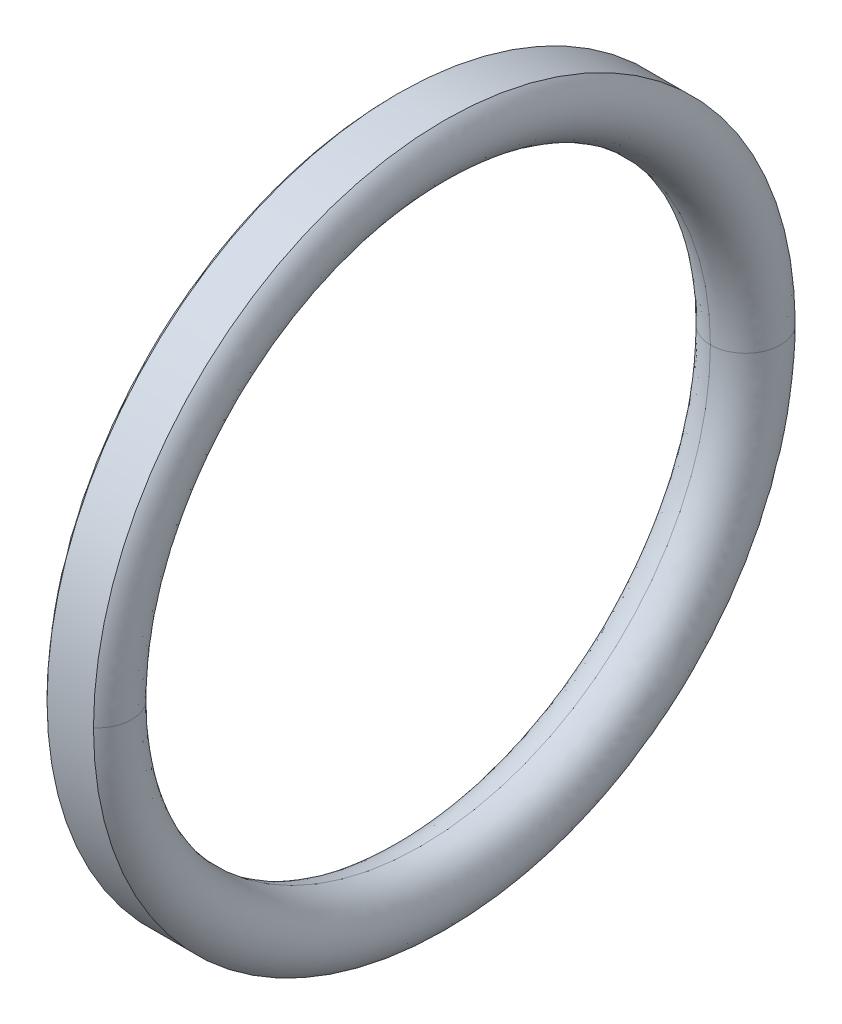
ISO-10303-21;
HEADER;
FILE_DESCRIPTION(('STEP AP214'),'2;1');
FILE_NAME('part.step','',(''),(''),'','','');
FILE_SCHEMA(('AUTOMOTIVE_DESIGN { 1 0 10303 214 1 1 1 1 }'));
ENDSEC;
DATA;
#1=APPLICATION_CONTEXT('core data for automotive mechanical design processes');
#2=APPLICATION_PROTOCOL_DEFINITION('international standard','automotive_design',2000,#1);
#3=PRODUCT_CONTEXT('',#1,'mechanical');
#4=PRODUCT('Part','Part','',(#3));
#5=PRODUCT_RELATED_PRODUCT_CATEGORY('part','',(#4));
#6=PRODUCT_DEFINITION_FORMATION('','',#4);
#7=PRODUCT_DEFINITION_CONTEXT('part definition',#1,'design');
#8=PRODUCT_DEFINITION('design','',#6,#7);
#9=PRODUCT_DEFINITION_SHAPE('','',#8);
#10=(LENGTH_UNIT() NAMED_UNIT(*) SI_UNIT(.MILLI.,.METRE.));
#11=(NAMED_UNIT(*) PLANE_ANGLE_UNIT() SI_UNIT($,.RADIAN.));
#12=(NAMED_UNIT(*) SI_UNIT($,.STERADIAN.) SOLID_ANGLE_UNIT());
#13=UNCERTAINTY_MEASURE_WITH_UNIT(LENGTH_MEASURE(1.E-05),#10,'distance_accuracy_value','');
#14=(GEOMETRIC_REPRESENTATION_CONTEXT(3) GLOBAL_UNCERTAINTY_ASSIGNED_CONTEXT((#13)) GLOBAL_UNIT_ASSIGNED_CONTEXT((#10,
#11,#12)) REPRESENTATION_CONTEXT('',''));
#15=CARTESIAN_POINT('',(0.,0.,0.));
#16=DIRECTION('',(0.,0.,1.));
#17=DIRECTION('',(1.,0.,0.));
#18=AXIS2_PLACEMENT_3D('',#15,#16,#17);
#19=CARTESIAN_POINT('',(0.,0.,8.25));
#20=CARTESIAN_POINT('',(0.,16.5,8.25));
#21=CARTESIAN_POINT('',(0.,16.5,-8.25));
#22=CARTESIAN_POINT('',(0.,0.,-8.25));
#23=CARTESIAN_POINT('',(-1.095906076,0.,8.25));
#24=CARTESIAN_POINT('',(-1.095906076,16.5,8.25));
#25=CARTESIAN_POINT('',(-1.095906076,16.5,-8.25));
#26=CARTESIAN_POINT('',(-1.095906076,0.,-8.25));
#27=CARTESIAN_POINT('',(-1.483367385,0.,9.275126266));
#28=CARTESIAN_POINT('',(-1.483367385,18.550252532,9.275126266));
#29=CARTESIAN_POINT('',(-1.483367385,18.550252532,-9.275126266));
#30=CARTESIAN_POINT('',(-1.483367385,0.,-9.275126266));
#31=CARTESIAN_POINT('',(-0.661437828,0.,10.));
#32=CARTESIAN_POINT('',(-0.661437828,20.,10.));
#33=CARTESIAN_POINT('',(-0.661437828,20.,-10.));
#34=CARTESIAN_POINT('',(-0.661437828,0.,-10.));
#35=(BOUNDED_SURFACE() B_SPLINE_SURFACE(3,3,((#19,#20,#21,#22),(#23,#24,#25,#26),(#27,#28,#29,
#30),(#31,#32,#33,#34)),.UNSPECIFIED.,.F.,.F.,.F.) B_SPLINE_SURFACE_WITH_KNOTS((4,4),(4,4),(0.,
1.),(0.,1.),.UNSPECIFIED.) GEOMETRIC_REPRESENTATION_ITEM() RATIONAL_B_SPLINE_SURFACE(((1.,
0.333333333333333,0.333333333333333,1.),(0.569035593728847,0.189678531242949,0.189678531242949,
0.569035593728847),(0.569035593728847,0.189678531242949,0.189678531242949,0.569035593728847),
(1.,0.333333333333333,0.333333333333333,1.))) REPRESENTATION_ITEM('') SURFACE());
#36=CARTESIAN_POINT('',(-0.661437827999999,0.,0.));
#37=DIRECTION('',(-1.,0.,0.));
#38=DIRECTION('',(0.,0.,1.));
#39=AXIS2_PLACEMENT_3D('',#36,#37,#38);
#40=CIRCLE('',#39,10.);
#41=CARTESIAN_POINT('',(-0.661437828,-1.53827571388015E-09,-10.));
#42=VERTEX_POINT('',#41);
#43=CARTESIAN_POINT('',(-0.661437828,-2.24484071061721E-10,10.));
#44=VERTEX_POINT('',#43);
#45=EDGE_CURVE('E72',#42,#44,#40,.F.);
#46=CARTESIAN_POINT('',(0.,0.,-8.25));
#47=CARTESIAN_POINT('',(-1.095906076,0.,-8.25));
#48=CARTESIAN_POINT('',(-1.483367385,0.,-9.275126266));
#49=CARTESIAN_POINT('',(-0.661437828,0.,-10.));
#50=(BOUNDED_CURVE() B_SPLINE_CURVE(3,(#46,#47,#48,#49),.UNSPECIFIED.,.F.,
.F.) B_SPLINE_CURVE_WITH_KNOTS((4,4),(0.,1.),
.UNSPECIFIED.) CURVE() GEOMETRIC_REPRESENTATION_ITEM() RATIONAL_B_SPLINE_CURVE((1.,
0.569035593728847,0.569035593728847,1.)) REPRESENTATION_ITEM(''));
#51=CARTESIAN_POINT('',(0.,0.,-8.25));
#52=VERTEX_POINT('',#51);
#53=EDGE_CURVE('E74',#52,#42,#50,.T.);
#54=CARTESIAN_POINT('',(0.,0.,0.));
#55=DIRECTION('',(-1.,0.,0.));
#56=DIRECTION('',(0.,0.,1.));
#57=AXIS2_PLACEMENT_3D('',#54,#55,#56);
#58=CIRCLE('',#57,8.25);
#59=CARTESIAN_POINT('',(0.,0.,8.25));
#60=VERTEX_POINT('',#59);
#61=EDGE_CURVE('E90',#60,#52,#58,.T.);
#62=CARTESIAN_POINT('',(0.,0.,8.25));
#63=CARTESIAN_POINT('',(-1.095906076,0.,8.25));
#64=CARTESIAN_POINT('',(-1.483367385,0.,9.275126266));
#65=CARTESIAN_POINT('',(-0.661437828,0.,10.));
#66=(BOUNDED_CURVE() B_SPLINE_CURVE(3,(#62,#63,#64,#65),.UNSPECIFIED.,.F.,
.F.) B_SPLINE_CURVE_WITH_KNOTS((4,4),(0.,1.),
.UNSPECIFIED.) CURVE() GEOMETRIC_REPRESENTATION_ITEM() RATIONAL_B_SPLINE_CURVE((1.,
0.569035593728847,0.569035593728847,1.)) REPRESENTATION_ITEM(''));
#67=EDGE_CURVE('E70',#44,#60,#66,.F.);
#68=ORIENTED_EDGE('',*,*,#45,.F.);
#69=ORIENTED_EDGE('',*,*,#53,.F.);
#70=ORIENTED_EDGE('',*,*,#61,.F.);
#71=ORIENTED_EDGE('',*,*,#67,.F.);
#72=EDGE_LOOP('',(#68,#69,#70,#71));
#73=FACE_BOUND('',#72,.T.);
#74=ADVANCED_FACE('F32',(#73),#35,.T.);
#75=CARTESIAN_POINT('',(0.,0.,-8.25));
#76=CARTESIAN_POINT('',(0.,-16.5,-8.25));
#77=CARTESIAN_POINT('',(0.,-16.5,8.25));
#78=CARTESIAN_POINT('',(0.,0.,8.25));
#79=CARTESIAN_POINT('',(-1.095906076,0.,-8.25));
#80=CARTESIAN_POINT('',(-1.095906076,-16.5,-8.25));
#81=CARTESIAN_POINT('',(-1.095906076,-16.5,8.25));
#82=CARTESIAN_POINT('',(-1.095906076,0.,8.25));
#83=CARTESIAN_POINT('',(-1.483367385,0.,-9.275126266));
#84=CARTESIAN_POINT('',(-1.483367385,-18.550252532,-9.275126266));
#85=CARTESIAN_POINT('',(-1.483367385,-18.550252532,9.275126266));
#86=CARTESIAN_POINT('',(-1.483367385,0.,9.275126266));
#87=CARTESIAN_POINT('',(-0.661437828,0.,-10.));
#88=CARTESIAN_POINT('',(-0.661437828,-20.,-10.));
#89=CARTESIAN_POINT('',(-0.661437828,-20.,10.));
#90=CARTESIAN_POINT('',(-0.661437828,0.,10.));
#91=(BOUNDED_SURFACE() B_SPLINE_SURFACE(3,3,((#75,#76,#77,#78),(#79,#80,#81,#82),(#83,#84,#85,
#86),(#87,#88,#89,#90)),.UNSPECIFIED.,.F.,.F.,.F.) B_SPLINE_SURFACE_WITH_KNOTS((4,4),(4,4),(0.,
1.),(0.,1.),.UNSPECIFIED.) GEOMETRIC_REPRESENTATION_ITEM() RATIONAL_B_SPLINE_SURFACE(((1.,
0.333333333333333,0.333333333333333,1.),(0.569035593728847,0.189678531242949,0.189678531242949,
0.569035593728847),(0.569035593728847,0.189678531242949,0.189678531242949,0.569035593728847),
(1.,0.333333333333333,0.333333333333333,1.))) REPRESENTATION_ITEM('') SURFACE());
#92=CARTESIAN_POINT('',(-0.661437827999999,0.,0.));
#93=DIRECTION('',(-1.,0.,0.));
#94=DIRECTION('',(0.,0.,1.));
#95=AXIS2_PLACEMENT_3D('',#92,#93,#94);
#96=CIRCLE('',#95,10.);
#97=EDGE_CURVE('E83',#44,#42,#96,.F.);
#98=CARTESIAN_POINT('',(0.,0.,0.));
#99=DIRECTION('',(-1.,0.,0.));
#100=DIRECTION('',(0.,0.,1.));
#101=AXIS2_PLACEMENT_3D('',#98,#99,#100);
#102=CIRCLE('',#101,8.25);
#103=EDGE_CURVE('E85',#52,#60,#102,.T.);
#104=ORIENTED_EDGE('',*,*,#97,.F.);
#105=ORIENTED_EDGE('',*,*,#67,.T.);
#106=ORIENTED_EDGE('',*,*,#103,.F.);
#107=ORIENTED_EDGE('',*,*,#53,.T.);
#108=EDGE_LOOP('',(#104,#105,#106,#107));
#109=FACE_BOUND('',#108,.T.);
#110=ADVANCED_FACE('F82',(#109),#91,.T.);
#111=CARTESIAN_POINT('',(0.661437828,0.,10.));
#112=CARTESIAN_POINT('',(0.661437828,20.,10.));
#113=CARTESIAN_POINT('',(0.661437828,20.,-10.));
#114=CARTESIAN_POINT('',(0.661437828,0.,-10.));
#115=CARTESIAN_POINT('',(1.483367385,0.,9.275126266));
#116=CARTESIAN_POINT('',(1.483367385,18.550252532,9.275126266));
#117=CARTESIAN_POINT('',(1.483367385,18.550252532,-9.275126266));
#118=CARTESIAN_POINT('',(1.483367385,0.,-9.275126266));
#119=CARTESIAN_POINT('',(1.095906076,0.,8.25));
#120=CARTESIAN_POINT('',(1.095906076,16.5,8.25));
#121=CARTESIAN_POINT('',(1.095906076,16.5,-8.25));
#122=CARTESIAN_POINT('',(1.095906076,0.,-8.25));
#123=CARTESIAN_POINT('',(0.,0.,8.25));
#124=CARTESIAN_POINT('',(0.,16.5,8.25));
#125=CARTESIAN_POINT('',(0.,16.5,-8.25));
#126=CARTESIAN_POINT('',(0.,0.,-8.25));
#127=(BOUNDED_SURFACE() B_SPLINE_SURFACE(3,3,((#111,#112,#113,#114),(#115,#116,#117,#118),(#119,
#120,#121,#122),(#123,#124,#125,#126)),.UNSPECIFIED.,.F.,.F.,
.F.) B_SPLINE_SURFACE_WITH_KNOTS((4,4),(4,4),(0.,1.),(0.,1.),
.UNSPECIFIED.) GEOMETRIC_REPRESENTATION_ITEM() RATIONAL_B_SPLINE_SURFACE(((1.,0.333333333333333,
0.333333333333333,1.),(0.569035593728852,0.189678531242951,0.189678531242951,0.569035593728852),
(0.569035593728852,0.189678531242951,0.189678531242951,0.569035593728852),(1.,0.333333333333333,
0.333333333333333,1.))) REPRESENTATION_ITEM('') SURFACE());
#128=CARTESIAN_POINT('',(0.661437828,0.,-10.));
#129=CARTESIAN_POINT('',(1.483367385,0.,-9.275126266));
#130=CARTESIAN_POINT('',(1.095906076,0.,-8.25));
#131=CARTESIAN_POINT('',(0.,0.,-8.25));
#132=(BOUNDED_CURVE() B_SPLINE_CURVE(3,(#128,#129,#130,#131),.UNSPECIFIED.,.F.,
.F.) B_SPLINE_CURVE_WITH_KNOTS((4,4),(0.,1.),
.UNSPECIFIED.) CURVE() GEOMETRIC_REPRESENTATION_ITEM() RATIONAL_B_SPLINE_CURVE((1.,
0.569035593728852,0.569035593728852,1.)) REPRESENTATION_ITEM(''));
#133=CARTESIAN_POINT('',(0.661437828,-2.56379285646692E-09,-10.));
#134=VERTEX_POINT('',#133);
#135=EDGE_CURVE('E38',#134,#52,#132,.T.);
#136=CARTESIAN_POINT('',(0.661437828,0.,0.));
#137=DIRECTION('',(1.,0.,0.));
#138=DIRECTION('',(0.,0.,-1.));
#139=AXIS2_PLACEMENT_3D('',#136,#137,#138);
#140=CIRCLE('',#139,10.);
#141=CARTESIAN_POINT('',(0.661437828,-2.24484071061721E-10,10.));
#142=VERTEX_POINT('',#141);
#143=EDGE_CURVE('E55',#134,#142,#140,.T.);
#144=CARTESIAN_POINT('',(0.661437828,0.,10.));
#145=CARTESIAN_POINT('',(1.483367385,0.,9.275126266));
#146=CARTESIAN_POINT('',(1.095906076,0.,8.25));
#147=CARTESIAN_POINT('',(0.,0.,8.25));
#148=(BOUNDED_CURVE() B_SPLINE_CURVE(3,(#144,#145,#146,#147),.UNSPECIFIED.,.F.,
.F.) B_SPLINE_CURVE_WITH_KNOTS((4,4),(0.,1.),
.UNSPECIFIED.) CURVE() GEOMETRIC_REPRESENTATION_ITEM() RATIONAL_B_SPLINE_CURVE((1.,
0.569035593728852,0.569035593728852,1.)) REPRESENTATION_ITEM(''));
#149=EDGE_CURVE('E46',#60,#142,#148,.F.);
#150=ORIENTED_EDGE('',*,*,#135,.F.);
#151=ORIENTED_EDGE('',*,*,#143,.T.);
#152=ORIENTED_EDGE('',*,*,#149,.F.);
#153=ORIENTED_EDGE('',*,*,#61,.T.);
#154=EDGE_LOOP('',(#150,#151,#152,#153));
#155=FACE_BOUND('',#154,.T.);
#156=ADVANCED_FACE('F101',(#155),#127,.T.);
#157=CARTESIAN_POINT('',(0.661437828,0.,0.));
#158=DIRECTION('',(-1.,0.,0.));
#159=DIRECTION('',(0.,0.,1.));
#160=AXIS2_PLACEMENT_3D('',#157,#158,#159);
#161=CYLINDRICAL_SURFACE('',#160,10.);
#162=ORIENTED_EDGE('',*,*,#143,.F.);
#163=CARTESIAN_POINT('',(0.661437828,0.,0.));
#164=DIRECTION('',(1.,0.,0.));
#165=DIRECTION('',(0.,0.,-1.));
#166=AXIS2_PLACEMENT_3D('',#163,#164,#165);
#167=CIRCLE('',#166,10.);
#168=EDGE_CURVE('E11',#142,#134,#167,.T.);
#169=ORIENTED_EDGE('',*,*,#168,.F.);
#170=EDGE_LOOP('',(#162,#169));
#171=FACE_BOUND('',#170,.T.);
#172=ORIENTED_EDGE('',*,*,#97,.T.);
#173=ORIENTED_EDGE('',*,*,#45,.T.);
#174=EDGE_LOOP('',(#172,#173));
#175=FACE_BOUND('',#174,.T.);
#176=ADVANCED_FACE('F88',(#171,#175),#161,.T.);
#177=CARTESIAN_POINT('',(0.661437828,0.,-10.));
#178=CARTESIAN_POINT('',(0.661437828,-20.,-10.));
#179=CARTESIAN_POINT('',(0.661437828,-20.,10.));
#180=CARTESIAN_POINT('',(0.661437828,0.,10.));
#181=CARTESIAN_POINT('',(1.483367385,0.,-9.275126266));
#182=CARTESIAN_POINT('',(1.483367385,-18.550252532,-9.275126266));
#183=CARTESIAN_POINT('',(1.483367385,-18.550252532,9.275126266));
#184=CARTESIAN_POINT('',(1.483367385,0.,9.275126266));
#185=CARTESIAN_POINT('',(1.095906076,0.,-8.25));
#186=CARTESIAN_POINT('',(1.095906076,-16.5,-8.25));
#187=CARTESIAN_POINT('',(1.095906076,-16.5,8.25));
#188=CARTESIAN_POINT('',(1.095906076,0.,8.25));
#189=CARTESIAN_POINT('',(0.,0.,-8.25));
#190=CARTESIAN_POINT('',(0.,-16.5,-8.25));
#191=CARTESIAN_POINT('',(0.,-16.5,8.25));
#192=CARTESIAN_POINT('',(0.,0.,8.25));
#193=(BOUNDED_SURFACE() B_SPLINE_SURFACE(3,3,((#177,#178,#179,#180),(#181,#182,#183,#184),(#185,
#186,#187,#188),(#189,#190,#191,#192)),.UNSPECIFIED.,.F.,.F.,
.F.) B_SPLINE_SURFACE_WITH_KNOTS((4,4),(4,4),(0.,1.),(0.,1.),
.UNSPECIFIED.) GEOMETRIC_REPRESENTATION_ITEM() RATIONAL_B_SPLINE_SURFACE(((1.,0.333333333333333,
0.333333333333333,1.),(0.569035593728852,0.189678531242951,0.189678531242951,0.569035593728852),
(0.569035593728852,0.189678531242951,0.189678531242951,0.569035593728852),(1.,0.333333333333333,
0.333333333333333,1.))) REPRESENTATION_ITEM('') SURFACE());
#194=ORIENTED_EDGE('',*,*,#149,.T.);
#195=ORIENTED_EDGE('',*,*,#168,.T.);
#196=ORIENTED_EDGE('',*,*,#135,.T.);
#197=ORIENTED_EDGE('',*,*,#103,.T.);
#198=EDGE_LOOP('',(#194,#195,#196,#197));
#199=FACE_BOUND('',#198,.T.);
#200=ADVANCED_FACE('F34',(#199),#193,.T.);
#201=CLOSED_SHELL('',(#74,#110,#156,#176,#200));
#202=MANIFOLD_SOLID_BREP('B2',#201);
#203=ADVANCED_BREP_SHAPE_REPRESENTATION('',(#18,#202),#14);
#204=SHAPE_DEFINITION_REPRESENTATION(#9,#203);
ENDSEC;
END-ISO-10303-21;
